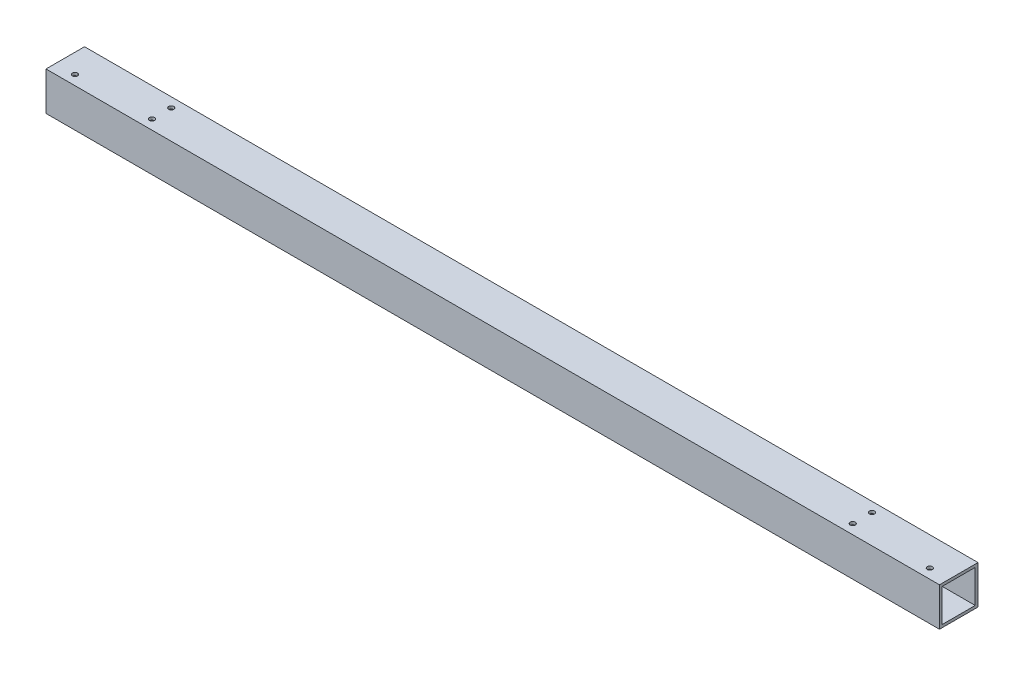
ISO-10303-21;
HEADER;
FILE_DESCRIPTION(('STEP AP214'),'2;1');
FILE_NAME('part.step','',(''),(''),'','','');
FILE_SCHEMA(('AUTOMOTIVE_DESIGN { 1 0 10303 214 1 1 1 1 }'));
ENDSEC;
DATA;
#1=APPLICATION_CONTEXT('core data for automotive mechanical design processes');
#2=APPLICATION_PROTOCOL_DEFINITION('international standard','automotive_design',2000,#1);
#3=PRODUCT_CONTEXT('',#1,'mechanical');
#4=PRODUCT('Part','Part','',(#3));
#5=PRODUCT_RELATED_PRODUCT_CATEGORY('part','',(#4));
#6=PRODUCT_DEFINITION_FORMATION('','',#4);
#7=PRODUCT_DEFINITION_CONTEXT('part definition',#1,'design');
#8=PRODUCT_DEFINITION('design','',#6,#7);
#9=PRODUCT_DEFINITION_SHAPE('','',#8);
#10=(LENGTH_UNIT() NAMED_UNIT(*) SI_UNIT(.MILLI.,.METRE.));
#11=(NAMED_UNIT(*) PLANE_ANGLE_UNIT() SI_UNIT($,.RADIAN.));
#12=(NAMED_UNIT(*) SI_UNIT($,.STERADIAN.) SOLID_ANGLE_UNIT());
#13=UNCERTAINTY_MEASURE_WITH_UNIT(LENGTH_MEASURE(1.E-05),#10,'distance_accuracy_value','');
#14=(GEOMETRIC_REPRESENTATION_CONTEXT(3) GLOBAL_UNCERTAINTY_ASSIGNED_CONTEXT((#13)) GLOBAL_UNIT_ASSIGNED_CONTEXT((#10,
#11,#12)) REPRESENTATION_CONTEXT('',''));
#15=CARTESIAN_POINT('',(0.,0.,0.));
#16=DIRECTION('',(0.,0.,1.));
#17=DIRECTION('',(1.,0.,0.));
#18=AXIS2_PLACEMENT_3D('',#15,#16,#17);
#19=CARTESIAN_POINT('',(0.,50.8,0.));
#20=DIRECTION('',(-1.,0.,0.));
#21=DIRECTION('',(0.,0.,1.));
#22=AXIS2_PLACEMENT_3D('',#19,#20,#21);
#23=PLANE('',#22);
#24=DIRECTION('',(0.,-1.,0.));
#25=VECTOR('',#24,1.);
#26=CARTESIAN_POINT('',(0.,0.,0.));
#27=LINE('',#26,#25);
#28=CARTESIAN_POINT('',(0.,50.8,0.));
#29=VERTEX_POINT('',#28);
#30=CARTESIAN_POINT('',(0.,0.,0.));
#31=VERTEX_POINT('',#30);
#32=EDGE_CURVE('E216',#29,#31,#27,.T.);
#33=ORIENTED_EDGE('',*,*,#32,.F.);
#34=DIRECTION('',(0.,0.,1.));
#35=VECTOR('',#34,1.);
#36=CARTESIAN_POINT('',(0.,50.8,0.));
#37=LINE('',#36,#35);
#38=CARTESIAN_POINT('',(0.,50.8,-50.7999999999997));
#39=VERTEX_POINT('',#38);
#40=EDGE_CURVE('E112',#39,#29,#37,.T.);
#41=ORIENTED_EDGE('',*,*,#40,.F.);
#42=DIRECTION('',(0.,1.,0.));
#43=VECTOR('',#42,1.);
#44=CARTESIAN_POINT('',(0.,0.,-50.7999999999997));
#45=LINE('',#44,#43);
#46=CARTESIAN_POINT('',(0.,0.,-50.7999999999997));
#47=VERTEX_POINT('',#46);
#48=EDGE_CURVE('E118',#47,#39,#45,.T.);
#49=ORIENTED_EDGE('',*,*,#48,.F.);
#50=DIRECTION('',(0.,0.,-1.));
#51=VECTOR('',#50,1.);
#52=CARTESIAN_POINT('',(0.,0.,0.));
#53=LINE('',#52,#51);
#54=EDGE_CURVE('E218',#31,#47,#53,.T.);
#55=ORIENTED_EDGE('',*,*,#54,.F.);
#56=EDGE_LOOP('',(#33,#41,#49,#55));
#57=FACE_BOUND('',#56,.T.);
#58=DIRECTION('',(0.,0.,1.));
#59=VECTOR('',#58,1.);
#60=CARTESIAN_POINT('',(0.,47.1423999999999,-3.65760000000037));
#61=LINE('',#60,#59);
#62=CARTESIAN_POINT('',(0.,47.1424,-47.1424000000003));
#63=VERTEX_POINT('',#62);
#64=CARTESIAN_POINT('',(0.,47.1423999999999,-3.65760000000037));
#65=VERTEX_POINT('',#64);
#66=EDGE_CURVE('E205',#63,#65,#61,.T.);
#67=ORIENTED_EDGE('',*,*,#66,.T.);
#68=DIRECTION('',(0.,-1.,0.));
#69=VECTOR('',#68,1.);
#70=CARTESIAN_POINT('',(0.,47.1423999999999,-3.65760000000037));
#71=LINE('',#70,#69);
#72=CARTESIAN_POINT('',(0.,3.65760000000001,-3.65760000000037));
#73=VERTEX_POINT('',#72);
#74=EDGE_CURVE('E196',#65,#73,#71,.T.);
#75=ORIENTED_EDGE('',*,*,#74,.T.);
#76=DIRECTION('',(0.,0.,-1.));
#77=VECTOR('',#76,1.);
#78=CARTESIAN_POINT('',(0.,3.65760000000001,-3.65760000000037));
#79=LINE('',#78,#77);
#80=CARTESIAN_POINT('',(0.,3.65760000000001,-47.1424000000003));
#81=VERTEX_POINT('',#80);
#82=EDGE_CURVE('E199',#73,#81,#79,.T.);
#83=ORIENTED_EDGE('',*,*,#82,.T.);
#84=DIRECTION('',(0.,1.,0.));
#85=VECTOR('',#84,1.);
#86=CARTESIAN_POINT('',(0.,47.1424,-47.1424000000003));
#87=LINE('',#86,#85);
#88=EDGE_CURVE('E202',#81,#63,#87,.T.);
#89=ORIENTED_EDGE('',*,*,#88,.T.);
#90=EDGE_LOOP('',(#67,#75,#83,#89));
#91=FACE_BOUND('',#90,.T.);
#92=ADVANCED_FACE('F30',(#57,#91),#23,.T.);
#93=CARTESIAN_POINT('',(3048.,-3.33066907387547E-13,0.));
#94=DIRECTION('',(0.,0.,-1.));
#95=DIRECTION('',(-1.,0.,0.));
#96=AXIS2_PLACEMENT_3D('',#93,#94,#95);
#97=PLANE('',#96);
#98=DIRECTION('',(-1.,0.,0.));
#99=VECTOR('',#98,1.);
#100=CARTESIAN_POINT('',(3048.,-3.33066907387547E-13,0.));
#101=LINE('',#100,#99);
#102=CARTESIAN_POINT('',(1177.798,-1.38777878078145E-13,0.));
#103=VERTEX_POINT('',#102);
#104=EDGE_CURVE('E39',#103,#31,#101,.T.);
#105=ORIENTED_EDGE('',*,*,#104,.F.);
#106=DIRECTION('',(0.,-1.,0.));
#107=VECTOR('',#106,1.);
#108=CARTESIAN_POINT('',(1177.798,166.474623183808,0.));
#109=LINE('',#108,#107);
#110=CARTESIAN_POINT('',(1177.798,50.7999999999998,0.));
#111=VERTEX_POINT('',#110);
#112=EDGE_CURVE('E96',#111,#103,#109,.T.);
#113=ORIENTED_EDGE('',*,*,#112,.F.);
#114=DIRECTION('',(-1.,0.,0.));
#115=VECTOR('',#114,1.);
#116=CARTESIAN_POINT('',(3048.,50.7999999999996,0.));
#117=LINE('',#116,#115);
#118=EDGE_CURVE('E106',#111,#29,#117,.T.);
#119=ORIENTED_EDGE('',*,*,#118,.T.);
#120=ORIENTED_EDGE('',*,*,#32,.T.);
#121=EDGE_LOOP('',(#105,#113,#119,#120));
#122=FACE_BOUND('',#121,.T.);
#123=ADVANCED_FACE('F32',(#122),#97,.F.);
#124=CARTESIAN_POINT('',(3048.,-3.33066907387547E-13,0.));
#125=DIRECTION('',(0.,1.,0.));
#126=DIRECTION('',(0.,0.,1.));
#127=AXIS2_PLACEMENT_3D('',#124,#125,#126);
#128=PLANE('',#127);
#129=CARTESIAN_POINT('',(127.,0.,-12.7000000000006));
#130=DIRECTION('',(0.,-1.,0.));
#131=DIRECTION('',(0.,0.,1.));
#132=AXIS2_PLACEMENT_3D('',#129,#130,#131);
#133=CIRCLE('',#132,3.37311999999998);
#134=CARTESIAN_POINT('',(127.,0.,-9.32688000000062));
#135=VERTEX_POINT('',#134);
#136=EDGE_CURVE('E438',#135,#135,#133,.T.);
#137=ORIENTED_EDGE('',*,*,#136,.F.);
#138=EDGE_LOOP('',(#137));
#139=FACE_BOUND('',#138,.T.);
#140=CARTESIAN_POINT('',(127.,0.,-38.1));
#141=DIRECTION('',(0.,-1.,0.));
#142=DIRECTION('',(0.,0.,1.));
#143=AXIS2_PLACEMENT_3D('',#140,#141,#142);
#144=CIRCLE('',#143,3.37311999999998);
#145=CARTESIAN_POINT('',(127.,0.,-34.72688));
#146=VERTEX_POINT('',#145);
#147=EDGE_CURVE('E152',#146,#146,#144,.T.);
#148=ORIENTED_EDGE('',*,*,#147,.F.);
#149=EDGE_LOOP('',(#148));
#150=FACE_BOUND('',#149,.T.);
#151=CARTESIAN_POINT('',(25.4000000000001,0.,-12.7000000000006));
#152=DIRECTION('',(0.,-1.,0.));
#153=DIRECTION('',(0.,0.,1.));
#154=AXIS2_PLACEMENT_3D('',#151,#152,#153);
#155=CIRCLE('',#154,3.37311999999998);
#156=CARTESIAN_POINT('',(25.4000000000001,0.,-9.32688000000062));
#157=VERTEX_POINT('',#156);
#158=EDGE_CURVE('E149',#157,#157,#155,.T.);
#159=ORIENTED_EDGE('',*,*,#158,.F.);
#160=EDGE_LOOP('',(#159));
#161=FACE_BOUND('',#160,.T.);
#162=CARTESIAN_POINT('',(1152.398,-1.66533453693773E-13,-12.7000000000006));
#163=DIRECTION('',(0.,-1.,0.));
#164=DIRECTION('',(0.,0.,-1.));
#165=AXIS2_PLACEMENT_3D('',#162,#163,#164);
#166=CIRCLE('',#165,3.37311999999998);
#167=CARTESIAN_POINT('',(1152.398,-1.6654125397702E-13,-16.0731200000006));
#168=VERTEX_POINT('',#167);
#169=EDGE_CURVE('E168',#168,#168,#166,.T.);
#170=ORIENTED_EDGE('',*,*,#169,.F.);
#171=EDGE_LOOP('',(#170));
#172=FACE_BOUND('',#171,.T.);
#173=CARTESIAN_POINT('',(1050.798,-1.38777878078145E-13,-38.1));
#174=DIRECTION('',(0.,-1.,0.));
#175=DIRECTION('',(0.,0.,-1.));
#176=AXIS2_PLACEMENT_3D('',#173,#174,#175);
#177=CIRCLE('',#176,3.37311999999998);
#178=CARTESIAN_POINT('',(1050.798,-1.38785678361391E-13,-41.47312));
#179=VERTEX_POINT('',#178);
#180=EDGE_CURVE('E175',#179,#179,#177,.T.);
#181=ORIENTED_EDGE('',*,*,#180,.F.);
#182=EDGE_LOOP('',(#181));
#183=FACE_BOUND('',#182,.T.);
#184=CARTESIAN_POINT('',(1050.798,-1.38777878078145E-13,-12.7000000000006));
#185=DIRECTION('',(0.,-1.,0.));
#186=DIRECTION('',(0.,0.,-1.));
#187=AXIS2_PLACEMENT_3D('',#184,#185,#186);
#188=CIRCLE('',#187,3.37311999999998);
#189=CARTESIAN_POINT('',(1050.798,-1.38785678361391E-13,-16.0731200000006));
#190=VERTEX_POINT('',#189);
#191=EDGE_CURVE('E182',#190,#190,#188,.T.);
#192=ORIENTED_EDGE('',*,*,#191,.F.);
#193=EDGE_LOOP('',(#192));
#194=FACE_BOUND('',#193,.T.);
#195=DIRECTION('',(-1.,0.,0.));
#196=VECTOR('',#195,1.);
#197=CARTESIAN_POINT('',(3048.,-3.88578058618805E-13,-50.8000000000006));
#198=LINE('',#197,#196);
#199=CARTESIAN_POINT('',(1177.798,-1.94289029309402E-13,-50.7999999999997));
#200=VERTEX_POINT('',#199);
#201=EDGE_CURVE('E116',#200,#47,#198,.T.);
#202=ORIENTED_EDGE('',*,*,#201,.F.);
#203=DIRECTION('',(0.,0.,1.));
#204=VECTOR('',#203,1.);
#205=CARTESIAN_POINT('',(1177.798,-1.38777878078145E-13,0.));
#206=LINE('',#205,#204);
#207=EDGE_CURVE('E101',#200,#103,#206,.T.);
#208=ORIENTED_EDGE('',*,*,#207,.T.);
#209=ORIENTED_EDGE('',*,*,#104,.T.);
#210=ORIENTED_EDGE('',*,*,#54,.T.);
#211=EDGE_LOOP('',(#202,#208,#209,#210));
#212=FACE_BOUND('',#211,.T.);
#213=ADVANCED_FACE('F229',(#139,#150,#161,#172,#183,#194,#212),#128,.F.);
#214=CARTESIAN_POINT('',(3048.,-3.88578058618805E-13,-50.8000000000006));
#215=DIRECTION('',(0.,0.,1.));
#216=DIRECTION('',(1.,0.,0.));
#217=AXIS2_PLACEMENT_3D('',#214,#215,#216);
#218=PLANE('',#217);
#219=DIRECTION('',(-1.,0.,0.));
#220=VECTOR('',#219,1.);
#221=CARTESIAN_POINT('',(3048.,50.7999999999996,-50.8000000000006));
#222=LINE('',#221,#220);
#223=CARTESIAN_POINT('',(1177.798,50.7999999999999,-50.7999999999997));
#224=VERTEX_POINT('',#223);
#225=EDGE_CURVE('E114',#224,#39,#222,.T.);
#226=ORIENTED_EDGE('',*,*,#225,.F.);
#227=DIRECTION('',(0.,-1.,0.));
#228=VECTOR('',#227,1.);
#229=CARTESIAN_POINT('',(1177.798,166.474623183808,-50.7999999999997));
#230=LINE('',#229,#228);
#231=EDGE_CURVE('E47',#224,#200,#230,.T.);
#232=ORIENTED_EDGE('',*,*,#231,.T.);
#233=ORIENTED_EDGE('',*,*,#201,.T.);
#234=ORIENTED_EDGE('',*,*,#48,.T.);
#235=EDGE_LOOP('',(#226,#232,#233,#234));
#236=FACE_BOUND('',#235,.T.);
#237=ADVANCED_FACE('F223',(#236),#218,.F.);
#238=CARTESIAN_POINT('',(3048.,50.7999999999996,0.));
#239=DIRECTION('',(0.,-1.,0.));
#240=DIRECTION('',(0.,0.,-1.));
#241=AXIS2_PLACEMENT_3D('',#238,#239,#240);
#242=PLANE('',#241);
#243=CARTESIAN_POINT('',(127.,50.7999999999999,-12.7000000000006));
#244=DIRECTION('',(0.,-1.,0.));
#245=DIRECTION('',(0.,0.,1.));
#246=AXIS2_PLACEMENT_3D('',#243,#244,#245);
#247=CIRCLE('',#246,3.37311999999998);
#248=CARTESIAN_POINT('',(127.,50.7999999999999,-9.32688000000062));
#249=VERTEX_POINT('',#248);
#250=EDGE_CURVE('E256',#249,#249,#247,.T.);
#251=ORIENTED_EDGE('',*,*,#250,.T.);
#252=EDGE_LOOP('',(#251));
#253=FACE_BOUND('',#252,.T.);
#254=CARTESIAN_POINT('',(127.,50.8,-38.1));
#255=DIRECTION('',(0.,-1.,0.));
#256=DIRECTION('',(0.,0.,1.));
#257=AXIS2_PLACEMENT_3D('',#254,#255,#256);
#258=CIRCLE('',#257,3.37311999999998);
#259=CARTESIAN_POINT('',(127.,50.8,-34.72688));
#260=VERTEX_POINT('',#259);
#261=EDGE_CURVE('E145',#260,#260,#258,.T.);
#262=ORIENTED_EDGE('',*,*,#261,.T.);
#263=EDGE_LOOP('',(#262));
#264=FACE_BOUND('',#263,.T.);
#265=CARTESIAN_POINT('',(25.4000000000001,50.8,-12.7000000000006));
#266=DIRECTION('',(0.,-1.,0.));
#267=DIRECTION('',(0.,0.,1.));
#268=AXIS2_PLACEMENT_3D('',#265,#266,#267);
#269=CIRCLE('',#268,3.37311999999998);
#270=CARTESIAN_POINT('',(25.4000000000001,50.8,-9.32688000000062));
#271=VERTEX_POINT('',#270);
#272=EDGE_CURVE('E141',#271,#271,#269,.T.);
#273=ORIENTED_EDGE('',*,*,#272,.T.);
#274=EDGE_LOOP('',(#273));
#275=FACE_BOUND('',#274,.T.);
#276=CARTESIAN_POINT('',(1152.398,50.7999999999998,-12.7000000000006));
#277=DIRECTION('',(0.,-1.,0.));
#278=DIRECTION('',(0.,0.,-1.));
#279=AXIS2_PLACEMENT_3D('',#276,#277,#278);
#280=CIRCLE('',#279,3.37311999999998);
#281=CARTESIAN_POINT('',(1152.398,50.7999999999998,-16.0731200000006));
#282=VERTEX_POINT('',#281);
#283=EDGE_CURVE('E137',#282,#282,#280,.T.);
#284=ORIENTED_EDGE('',*,*,#283,.T.);
#285=EDGE_LOOP('',(#284));
#286=FACE_BOUND('',#285,.T.);
#287=CARTESIAN_POINT('',(1050.798,50.7999999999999,-38.1));
#288=DIRECTION('',(0.,-1.,0.));
#289=DIRECTION('',(0.,0.,-1.));
#290=AXIS2_PLACEMENT_3D('',#287,#288,#289);
#291=CIRCLE('',#290,3.37311999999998);
#292=CARTESIAN_POINT('',(1050.798,50.7999999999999,-41.47312));
#293=VERTEX_POINT('',#292);
#294=EDGE_CURVE('E132',#293,#293,#291,.T.);
#295=ORIENTED_EDGE('',*,*,#294,.T.);
#296=EDGE_LOOP('',(#295));
#297=FACE_BOUND('',#296,.T.);
#298=CARTESIAN_POINT('',(1050.798,50.7999999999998,-12.7000000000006));
#299=DIRECTION('',(0.,-1.,0.));
#300=DIRECTION('',(0.,0.,-1.));
#301=AXIS2_PLACEMENT_3D('',#298,#299,#300);
#302=CIRCLE('',#301,3.37311999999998);
#303=CARTESIAN_POINT('',(1050.798,50.7999999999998,-16.0731200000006));
#304=VERTEX_POINT('',#303);
#305=EDGE_CURVE('E127',#304,#304,#302,.T.);
#306=ORIENTED_EDGE('',*,*,#305,.T.);
#307=EDGE_LOOP('',(#306));
#308=FACE_BOUND('',#307,.T.);
#309=ORIENTED_EDGE('',*,*,#118,.F.);
#310=DIRECTION('',(0.,0.,-1.));
#311=VECTOR('',#310,1.);
#312=CARTESIAN_POINT('',(1177.798,50.7999999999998,0.));
#313=LINE('',#312,#311);
#314=EDGE_CURVE('E93',#111,#224,#313,.T.);
#315=ORIENTED_EDGE('',*,*,#314,.T.);
#316=ORIENTED_EDGE('',*,*,#225,.T.);
#317=ORIENTED_EDGE('',*,*,#40,.T.);
#318=EDGE_LOOP('',(#309,#315,#316,#317));
#319=FACE_BOUND('',#318,.T.);
#320=ADVANCED_FACE('F110',(#253,#264,#275,#286,#297,#308,#319),#242,.F.);
#321=CARTESIAN_POINT('',(3048.,47.1423999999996,-3.65760000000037));
#322=DIRECTION('',(0.,0.,-1.));
#323=DIRECTION('',(0.,1.,0.));
#324=AXIS2_PLACEMENT_3D('',#321,#322,#323);
#325=PLANE('',#324);
#326=DIRECTION('',(0.,1.,0.));
#327=VECTOR('',#326,1.);
#328=CARTESIAN_POINT('',(1177.798,47.1423999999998,-3.65760000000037));
#329=LINE('',#328,#327);
#330=CARTESIAN_POINT('',(1177.798,3.65759999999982,-3.65760000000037));
#331=VERTEX_POINT('',#330);
#332=CARTESIAN_POINT('',(1177.798,47.1423999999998,-3.65760000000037));
#333=VERTEX_POINT('',#332);
#334=EDGE_CURVE('E54',#331,#333,#329,.T.);
#335=ORIENTED_EDGE('',*,*,#334,.F.);
#336=DIRECTION('',(-1.,0.,0.));
#337=VECTOR('',#336,1.);
#338=CARTESIAN_POINT('',(3048.,3.65759999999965,-3.65760000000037));
#339=LINE('',#338,#337);
#340=EDGE_CURVE('E214',#331,#73,#339,.T.);
#341=ORIENTED_EDGE('',*,*,#340,.T.);
#342=ORIENTED_EDGE('',*,*,#74,.F.);
#343=DIRECTION('',(-1.,0.,0.));
#344=VECTOR('',#343,1.);
#345=CARTESIAN_POINT('',(3048.,47.1423999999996,-3.65760000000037));
#346=LINE('',#345,#344);
#347=EDGE_CURVE('E208',#333,#65,#346,.T.);
#348=ORIENTED_EDGE('',*,*,#347,.F.);
#349=EDGE_LOOP('',(#335,#341,#342,#348));
#350=FACE_BOUND('',#349,.T.);
#351=ADVANCED_FACE('F245',(#350),#325,.T.);
#352=CARTESIAN_POINT('',(3048.,3.65759999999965,-3.65760000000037));
#353=DIRECTION('',(0.,1.,0.));
#354=DIRECTION('',(0.,0.,1.));
#355=AXIS2_PLACEMENT_3D('',#352,#353,#354);
#356=PLANE('',#355);
#357=CARTESIAN_POINT('',(127.,3.65759999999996,-12.7000000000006));
#358=DIRECTION('',(0.,1.,0.));
#359=DIRECTION('',(0.,0.,1.));
#360=AXIS2_PLACEMENT_3D('',#357,#358,#359);
#361=CIRCLE('',#360,3.37311999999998);
#362=CARTESIAN_POINT('',(127.,3.65759999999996,-9.32688000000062));
#363=VERTEX_POINT('',#362);
#364=EDGE_CURVE('E157',#363,#363,#361,.T.);
#365=ORIENTED_EDGE('',*,*,#364,.F.);
#366=EDGE_LOOP('',(#365));
#367=FACE_BOUND('',#366,.T.);
#368=CARTESIAN_POINT('',(127.,3.65759999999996,-38.1));
#369=DIRECTION('',(0.,1.,0.));
#370=DIRECTION('',(0.,0.,1.));
#371=AXIS2_PLACEMENT_3D('',#368,#369,#370);
#372=CIRCLE('',#371,3.37311999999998);
#373=CARTESIAN_POINT('',(127.,3.65759999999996,-34.72688));
#374=VERTEX_POINT('',#373);
#375=EDGE_CURVE('E144',#374,#374,#372,.T.);
#376=ORIENTED_EDGE('',*,*,#375,.F.);
#377=EDGE_LOOP('',(#376));
#378=FACE_BOUND('',#377,.T.);
#379=CARTESIAN_POINT('',(25.4000000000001,3.65759999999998,-12.7000000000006));
#380=DIRECTION('',(0.,1.,0.));
#381=DIRECTION('',(0.,0.,1.));
#382=AXIS2_PLACEMENT_3D('',#379,#380,#381);
#383=CIRCLE('',#382,3.37311999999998);
#384=CARTESIAN_POINT('',(25.4000000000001,3.65759999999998,-9.32688000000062));
#385=VERTEX_POINT('',#384);
#386=EDGE_CURVE('E140',#385,#385,#383,.T.);
#387=ORIENTED_EDGE('',*,*,#386,.F.);
#388=EDGE_LOOP('',(#387));
#389=FACE_BOUND('',#388,.T.);
#390=CARTESIAN_POINT('',(1152.398,3.65759999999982,-12.7000000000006));
#391=DIRECTION('',(0.,1.,0.));
#392=DIRECTION('',(0.,0.,1.));
#393=AXIS2_PLACEMENT_3D('',#390,#391,#392);
#394=CIRCLE('',#393,3.37311999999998);
#395=CARTESIAN_POINT('',(1152.398,3.65759999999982,-9.32688000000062));
#396=VERTEX_POINT('',#395);
#397=EDGE_CURVE('E136',#396,#396,#394,.T.);
#398=ORIENTED_EDGE('',*,*,#397,.F.);
#399=EDGE_LOOP('',(#398));
#400=FACE_BOUND('',#399,.T.);
#401=CARTESIAN_POINT('',(1050.798,3.65759999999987,-38.1));
#402=DIRECTION('',(0.,1.,0.));
#403=DIRECTION('',(0.,0.,1.));
#404=AXIS2_PLACEMENT_3D('',#401,#402,#403);
#405=CIRCLE('',#404,3.37311999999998);
#406=CARTESIAN_POINT('',(1050.798,3.65759999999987,-34.72688));
#407=VERTEX_POINT('',#406);
#408=EDGE_CURVE('E131',#407,#407,#405,.T.);
#409=ORIENTED_EDGE('',*,*,#408,.F.);
#410=EDGE_LOOP('',(#409));
#411=FACE_BOUND('',#410,.T.);
#412=CARTESIAN_POINT('',(1050.798,3.65759999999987,-12.7000000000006));
#413=DIRECTION('',(0.,1.,0.));
#414=DIRECTION('',(0.,0.,1.));
#415=AXIS2_PLACEMENT_3D('',#412,#413,#414);
#416=CIRCLE('',#415,3.37311999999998);
#417=CARTESIAN_POINT('',(1050.798,3.65759999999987,-9.32688000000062));
#418=VERTEX_POINT('',#417);
#419=EDGE_CURVE('E108',#418,#418,#416,.T.);
#420=ORIENTED_EDGE('',*,*,#419,.F.);
#421=EDGE_LOOP('',(#420));
#422=FACE_BOUND('',#421,.T.);
#423=DIRECTION('',(0.,0.,1.));
#424=VECTOR('',#423,1.);
#425=CARTESIAN_POINT('',(1177.798,3.65759999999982,-3.65760000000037));
#426=LINE('',#425,#424);
#427=CARTESIAN_POINT('',(1177.798,3.65759999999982,-47.1424000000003));
#428=VERTEX_POINT('',#427);
#429=EDGE_CURVE('E192',#428,#331,#426,.T.);
#430=ORIENTED_EDGE('',*,*,#429,.F.);
#431=DIRECTION('',(-1.,0.,0.));
#432=VECTOR('',#431,1.);
#433=CARTESIAN_POINT('',(3048.,3.65759999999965,-47.1424000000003));
#434=LINE('',#433,#432);
#435=EDGE_CURVE('E212',#428,#81,#434,.T.);
#436=ORIENTED_EDGE('',*,*,#435,.T.);
#437=ORIENTED_EDGE('',*,*,#82,.F.);
#438=ORIENTED_EDGE('',*,*,#340,.F.);
#439=EDGE_LOOP('',(#430,#436,#437,#438));
#440=FACE_BOUND('',#439,.T.);
#441=ADVANCED_FACE('F252',(#367,#378,#389,#400,#411,#422,#440),#356,.T.);
#442=CARTESIAN_POINT('',(3048.,47.1423999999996,-47.1424000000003));
#443=DIRECTION('',(0.,0.,1.));
#444=DIRECTION('',(0.,-1.,0.));
#445=AXIS2_PLACEMENT_3D('',#442,#443,#444);
#446=PLANE('',#445);
#447=DIRECTION('',(0.,-1.,0.));
#448=VECTOR('',#447,1.);
#449=CARTESIAN_POINT('',(1177.798,47.1423999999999,-47.1424000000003));
#450=LINE('',#449,#448);
#451=CARTESIAN_POINT('',(1177.798,47.1423999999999,-47.1424000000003));
#452=VERTEX_POINT('',#451);
#453=EDGE_CURVE('E189',#452,#428,#450,.T.);
#454=ORIENTED_EDGE('',*,*,#453,.F.);
#455=DIRECTION('',(-1.,0.,0.));
#456=VECTOR('',#455,1.);
#457=CARTESIAN_POINT('',(3048.,47.1423999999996,-47.1424000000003));
#458=LINE('',#457,#456);
#459=EDGE_CURVE('E210',#452,#63,#458,.T.);
#460=ORIENTED_EDGE('',*,*,#459,.T.);
#461=ORIENTED_EDGE('',*,*,#88,.F.);
#462=ORIENTED_EDGE('',*,*,#435,.F.);
#463=EDGE_LOOP('',(#454,#460,#461,#462));
#464=FACE_BOUND('',#463,.T.);
#465=ADVANCED_FACE('F284',(#464),#446,.T.);
#466=CARTESIAN_POINT('',(3048.,47.1423999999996,-3.65760000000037));
#467=DIRECTION('',(0.,-1.,0.));
#468=DIRECTION('',(0.,0.,-1.));
#469=AXIS2_PLACEMENT_3D('',#466,#467,#468);
#470=PLANE('',#469);
#471=CARTESIAN_POINT('',(127.,47.1423999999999,-12.7000000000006));
#472=DIRECTION('',(0.,-1.,0.));
#473=DIRECTION('',(0.,0.,-1.));
#474=AXIS2_PLACEMENT_3D('',#471,#472,#473);
#475=CIRCLE('',#474,3.37311999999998);
#476=CARTESIAN_POINT('',(127.,47.1423999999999,-16.0731200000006));
#477=VERTEX_POINT('',#476);
#478=EDGE_CURVE('E34',#477,#477,#475,.T.);
#479=ORIENTED_EDGE('',*,*,#478,.F.);
#480=EDGE_LOOP('',(#479));
#481=FACE_BOUND('',#480,.T.);
#482=CARTESIAN_POINT('',(127.,47.1424,-38.1));
#483=DIRECTION('',(0.,-1.,0.));
#484=DIRECTION('',(0.,0.,-1.));
#485=AXIS2_PLACEMENT_3D('',#482,#483,#484);
#486=CIRCLE('',#485,3.37311999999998);
#487=CARTESIAN_POINT('',(127.,47.1424,-41.47312));
#488=VERTEX_POINT('',#487);
#489=EDGE_CURVE('E142',#488,#488,#486,.T.);
#490=ORIENTED_EDGE('',*,*,#489,.F.);
#491=EDGE_LOOP('',(#490));
#492=FACE_BOUND('',#491,.T.);
#493=CARTESIAN_POINT('',(25.4000000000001,47.1423999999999,-12.7000000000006));
#494=DIRECTION('',(0.,-1.,0.));
#495=DIRECTION('',(0.,0.,-1.));
#496=AXIS2_PLACEMENT_3D('',#493,#494,#495);
#497=CIRCLE('',#496,3.37311999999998);
#498=CARTESIAN_POINT('',(25.4000000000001,47.1423999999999,-16.0731200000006));
#499=VERTEX_POINT('',#498);
#500=EDGE_CURVE('E138',#499,#499,#497,.T.);
#501=ORIENTED_EDGE('',*,*,#500,.F.);
#502=EDGE_LOOP('',(#501));
#503=FACE_BOUND('',#502,.T.);
#504=CARTESIAN_POINT('',(1152.398,47.1423999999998,-12.7000000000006));
#505=DIRECTION('',(0.,-1.,0.));
#506=DIRECTION('',(0.,0.,-1.));
#507=AXIS2_PLACEMENT_3D('',#504,#505,#506);
#508=CIRCLE('',#507,3.37311999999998);
#509=CARTESIAN_POINT('',(1152.398,47.1423999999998,-16.0731200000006));
#510=VERTEX_POINT('',#509);
#511=EDGE_CURVE('E133',#510,#510,#508,.T.);
#512=ORIENTED_EDGE('',*,*,#511,.F.);
#513=EDGE_LOOP('',(#512));
#514=FACE_BOUND('',#513,.T.);
#515=CARTESIAN_POINT('',(1050.798,47.1423999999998,-38.1));
#516=DIRECTION('',(0.,-1.,0.));
#517=DIRECTION('',(0.,0.,-1.));
#518=AXIS2_PLACEMENT_3D('',#515,#516,#517);
#519=CIRCLE('',#518,3.37311999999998);
#520=CARTESIAN_POINT('',(1050.798,47.1423999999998,-41.47312));
#521=VERTEX_POINT('',#520);
#522=EDGE_CURVE('E128',#521,#521,#519,.T.);
#523=ORIENTED_EDGE('',*,*,#522,.F.);
#524=EDGE_LOOP('',(#523));
#525=FACE_BOUND('',#524,.T.);
#526=CARTESIAN_POINT('',(1050.798,47.1423999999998,-12.7000000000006));
#527=DIRECTION('',(0.,-1.,0.));
#528=DIRECTION('',(0.,0.,-1.));
#529=AXIS2_PLACEMENT_3D('',#526,#527,#528);
#530=CIRCLE('',#529,3.37311999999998);
#531=CARTESIAN_POINT('',(1050.798,47.1423999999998,-16.0731200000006));
#532=VERTEX_POINT('',#531);
#533=EDGE_CURVE('E124',#532,#532,#530,.T.);
#534=ORIENTED_EDGE('',*,*,#533,.F.);
#535=EDGE_LOOP('',(#534));
#536=FACE_BOUND('',#535,.T.);
#537=DIRECTION('',(0.,0.,-1.));
#538=VECTOR('',#537,1.);
#539=CARTESIAN_POINT('',(1177.798,47.1423999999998,-3.65760000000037));
#540=LINE('',#539,#538);
#541=EDGE_CURVE('E11',#333,#452,#540,.T.);
#542=ORIENTED_EDGE('',*,*,#541,.F.);
#543=ORIENTED_EDGE('',*,*,#347,.T.);
#544=ORIENTED_EDGE('',*,*,#66,.F.);
#545=ORIENTED_EDGE('',*,*,#459,.F.);
#546=EDGE_LOOP('',(#542,#543,#544,#545));
#547=FACE_BOUND('',#546,.T.);
#548=ADVANCED_FACE('F277',(#481,#492,#503,#514,#525,#536,#547),#470,.T.);
#549=CARTESIAN_POINT('',(1177.798,166.474623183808,-50.7999999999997));
#550=DIRECTION('',(-1.,0.,0.));
#551=DIRECTION('',(0.,0.,1.));
#552=AXIS2_PLACEMENT_3D('',#549,#550,#551);
#553=PLANE('',#552);
#554=ORIENTED_EDGE('',*,*,#334,.T.);
#555=ORIENTED_EDGE('',*,*,#541,.T.);
#556=ORIENTED_EDGE('',*,*,#453,.T.);
#557=ORIENTED_EDGE('',*,*,#429,.T.);
#558=EDGE_LOOP('',(#554,#555,#556,#557));
#559=FACE_BOUND('',#558,.T.);
#560=ORIENTED_EDGE('',*,*,#231,.F.);
#561=ORIENTED_EDGE('',*,*,#314,.F.);
#562=ORIENTED_EDGE('',*,*,#112,.T.);
#563=ORIENTED_EDGE('',*,*,#207,.F.);
#564=EDGE_LOOP('',(#560,#561,#562,#563));
#565=FACE_BOUND('',#564,.T.);
#566=ADVANCED_FACE('F95',(#559,#565),#553,.F.);
#567=CARTESIAN_POINT('',(1050.798,50.7999999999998,-12.7000000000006));
#568=DIRECTION('',(0.,-1.,0.));
#569=DIRECTION('',(0.,0.,-1.));
#570=AXIS2_PLACEMENT_3D('',#567,#568,#569);
#571=CYLINDRICAL_SURFACE('',#570,3.37311999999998);
#572=ORIENTED_EDGE('',*,*,#533,.T.);
#573=EDGE_LOOP('',(#572));
#574=FACE_BOUND('',#573,.T.);
#575=ORIENTED_EDGE('',*,*,#305,.F.);
#576=EDGE_LOOP('',(#575));
#577=FACE_BOUND('',#576,.T.);
#578=ADVANCED_FACE('F266',(#574,#577),#571,.F.);
#579=ORIENTED_EDGE('',*,*,#419,.T.);
#580=EDGE_LOOP('',(#579));
#581=FACE_BOUND('',#580,.T.);
#582=ORIENTED_EDGE('',*,*,#191,.T.);
#583=EDGE_LOOP('',(#582));
#584=FACE_BOUND('',#583,.T.);
#585=ADVANCED_FACE('F268',(#581,#584),#571,.F.);
#586=CARTESIAN_POINT('',(1050.798,50.7999999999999,-38.1));
#587=DIRECTION('',(0.,-1.,0.));
#588=DIRECTION('',(0.,0.,-1.));
#589=AXIS2_PLACEMENT_3D('',#586,#587,#588);
#590=CYLINDRICAL_SURFACE('',#589,3.37311999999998);
#591=ORIENTED_EDGE('',*,*,#522,.T.);
#592=EDGE_LOOP('',(#591));
#593=FACE_BOUND('',#592,.T.);
#594=ORIENTED_EDGE('',*,*,#294,.F.);
#595=EDGE_LOOP('',(#594));
#596=FACE_BOUND('',#595,.T.);
#597=ADVANCED_FACE('F275',(#593,#596),#590,.F.);
#598=ORIENTED_EDGE('',*,*,#408,.T.);
#599=EDGE_LOOP('',(#598));
#600=FACE_BOUND('',#599,.T.);
#601=ORIENTED_EDGE('',*,*,#180,.T.);
#602=EDGE_LOOP('',(#601));
#603=FACE_BOUND('',#602,.T.);
#604=ADVANCED_FACE('F320',(#600,#603),#590,.F.);
#605=CARTESIAN_POINT('',(1152.398,50.7999999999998,-12.7000000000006));
#606=DIRECTION('',(0.,-1.,0.));
#607=DIRECTION('',(0.,0.,-1.));
#608=AXIS2_PLACEMENT_3D('',#605,#606,#607);
#609=CYLINDRICAL_SURFACE('',#608,3.37311999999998);
#610=ORIENTED_EDGE('',*,*,#511,.T.);
#611=EDGE_LOOP('',(#610));
#612=FACE_BOUND('',#611,.T.);
#613=ORIENTED_EDGE('',*,*,#283,.F.);
#614=EDGE_LOOP('',(#613));
#615=FACE_BOUND('',#614,.T.);
#616=ADVANCED_FACE('F323',(#612,#615),#609,.F.);
#617=ORIENTED_EDGE('',*,*,#397,.T.);
#618=EDGE_LOOP('',(#617));
#619=FACE_BOUND('',#618,.T.);
#620=ORIENTED_EDGE('',*,*,#169,.T.);
#621=EDGE_LOOP('',(#620));
#622=FACE_BOUND('',#621,.T.);
#623=ADVANCED_FACE('F330',(#619,#622),#609,.F.);
#624=CARTESIAN_POINT('',(25.4000000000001,50.8,-12.7000000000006));
#625=DIRECTION('',(0.,-1.,0.));
#626=DIRECTION('',(0.,0.,-1.));
#627=AXIS2_PLACEMENT_3D('',#624,#625,#626);
#628=CYLINDRICAL_SURFACE('',#627,3.37311999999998);
#629=ORIENTED_EDGE('',*,*,#500,.T.);
#630=EDGE_LOOP('',(#629));
#631=FACE_BOUND('',#630,.T.);
#632=ORIENTED_EDGE('',*,*,#272,.F.);
#633=EDGE_LOOP('',(#632));
#634=FACE_BOUND('',#633,.T.);
#635=ADVANCED_FACE('F391',(#631,#634),#628,.F.);
#636=ORIENTED_EDGE('',*,*,#386,.T.);
#637=EDGE_LOOP('',(#636));
#638=FACE_BOUND('',#637,.T.);
#639=ORIENTED_EDGE('',*,*,#158,.T.);
#640=EDGE_LOOP('',(#639));
#641=FACE_BOUND('',#640,.T.);
#642=ADVANCED_FACE('F398',(#638,#641),#628,.F.);
#643=CARTESIAN_POINT('',(127.,50.8,-38.1));
#644=DIRECTION('',(0.,-1.,0.));
#645=DIRECTION('',(0.,0.,-1.));
#646=AXIS2_PLACEMENT_3D('',#643,#644,#645);
#647=CYLINDRICAL_SURFACE('',#646,3.37311999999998);
#648=ORIENTED_EDGE('',*,*,#489,.T.);
#649=EDGE_LOOP('',(#648));
#650=FACE_BOUND('',#649,.T.);
#651=ORIENTED_EDGE('',*,*,#261,.F.);
#652=EDGE_LOOP('',(#651));
#653=FACE_BOUND('',#652,.T.);
#654=ADVANCED_FACE('F406',(#650,#653),#647,.F.);
#655=ORIENTED_EDGE('',*,*,#375,.T.);
#656=EDGE_LOOP('',(#655));
#657=FACE_BOUND('',#656,.T.);
#658=ORIENTED_EDGE('',*,*,#147,.T.);
#659=EDGE_LOOP('',(#658));
#660=FACE_BOUND('',#659,.T.);
#661=ADVANCED_FACE('F413',(#657,#660),#647,.F.);
#662=CARTESIAN_POINT('',(127.,50.7999999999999,-12.7000000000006));
#663=DIRECTION('',(0.,-1.,0.));
#664=DIRECTION('',(0.,0.,-1.));
#665=AXIS2_PLACEMENT_3D('',#662,#663,#664);
#666=CYLINDRICAL_SURFACE('',#665,3.37311999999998);
#667=ORIENTED_EDGE('',*,*,#478,.T.);
#668=EDGE_LOOP('',(#667));
#669=FACE_BOUND('',#668,.T.);
#670=ORIENTED_EDGE('',*,*,#250,.F.);
#671=EDGE_LOOP('',(#670));
#672=FACE_BOUND('',#671,.T.);
#673=ADVANCED_FACE('F420',(#669,#672),#666,.F.);
#674=ORIENTED_EDGE('',*,*,#364,.T.);
#675=EDGE_LOOP('',(#674));
#676=FACE_BOUND('',#675,.T.);
#677=ORIENTED_EDGE('',*,*,#136,.T.);
#678=EDGE_LOOP('',(#677));
#679=FACE_BOUND('',#678,.T.);
#680=ADVANCED_FACE('F427',(#676,#679),#666,.F.);
#681=CLOSED_SHELL('',(#92,#123,#213,#237,#320,#351,#441,#465,#548,#566,#578,#585,#597,#604,#616,
#623,#635,#642,#654,#661,#673,#680));
#682=MANIFOLD_SOLID_BREP('B2',#681);
#683=ADVANCED_BREP_SHAPE_REPRESENTATION('',(#18,#682),#14);
#684=SHAPE_DEFINITION_REPRESENTATION(#9,#683);
ENDSEC;
END-ISO-10303-21;
